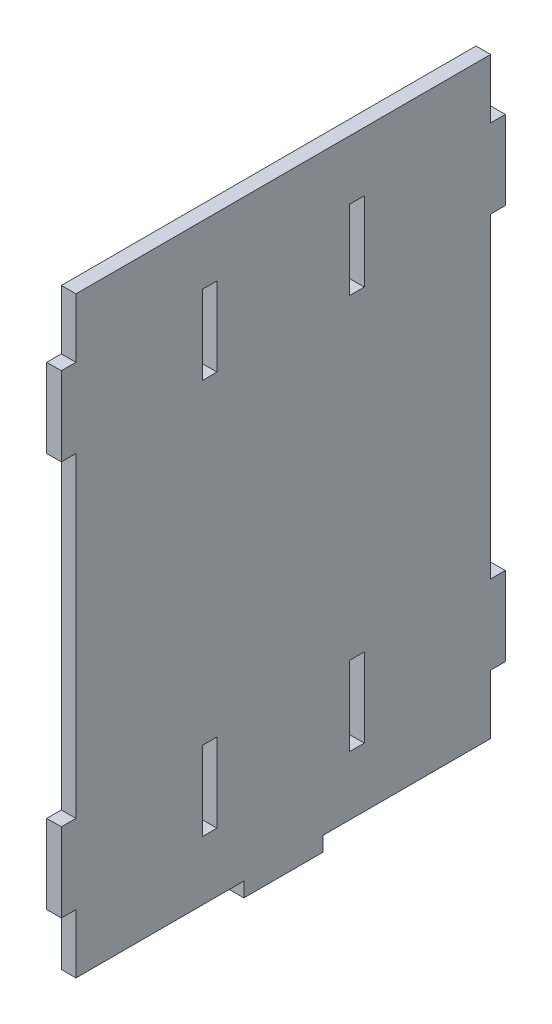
from build123d import *

# Parameters (mm, degrees)
SKETCH1_W      = 3.7
SKETCH1_H      = 20
EXTRUDE1_DEPTH = 3.7


with BuildPart() as part:
    # Sketch1 → Extrude1 (new body)
    with BuildSketch(Plane(origin=(0, 0, 0), x_dir=(0, 0, -1), z_dir=(1, 0, 0))):
        Polygon((52.5, 135), (56.2, 135), (56.2, 115), (52.5, 115), (52.5, 35), (56.2, 35), (56.2, 15), (52.5, 15), (52.5, 0), (10, 0), (10, -3.7), (-10, -3.7), (-10, 0), (-52.5, 0), (-52.5, 15), (-56.2, 15), (-56.2, 35), (-52.5, 35), (-52.5, 115), (-56.2, 115), (-56.2, 135), (-52.5, 135), (-52.5, 150), (52.5, 150), align=None)
        with Locations((-18.65, 125)):
            Rectangle(SKETCH1_W, SKETCH1_H, mode=Mode.SUBTRACT)
        with Locations((18.65, 125)):
            Rectangle(SKETCH1_W, SKETCH1_H, mode=Mode.SUBTRACT)
        with Locations((-18.65, 25)):
            Rectangle(SKETCH1_W, SKETCH1_H, mode=Mode.SUBTRACT)
        with Locations((18.65, 25)):
            Rectangle(SKETCH1_W, SKETCH1_H, mode=Mode.SUBTRACT)
    extrude(amount=EXTRUDE1_DEPTH)


solid = part.part
